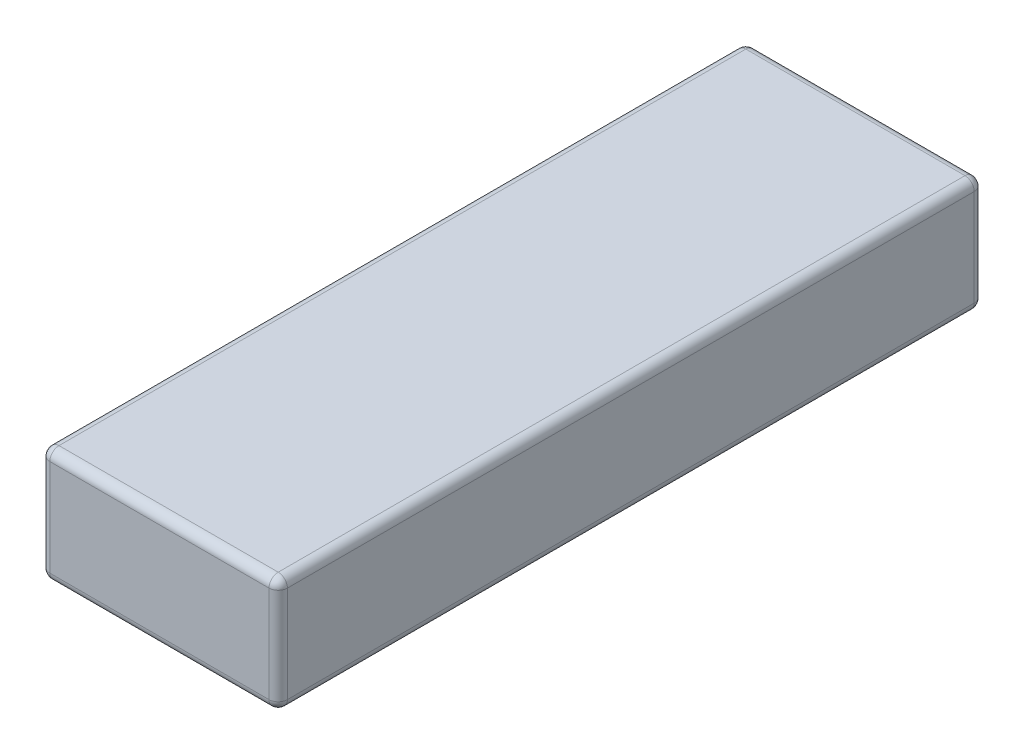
ISO-10303-21;
HEADER;
FILE_DESCRIPTION(('STEP AP214'),'2;1');
FILE_NAME('part.step','',(''),(''),'','','');
FILE_SCHEMA(('AUTOMOTIVE_DESIGN { 1 0 10303 214 1 1 1 1 }'));
ENDSEC;
DATA;
#1=APPLICATION_CONTEXT('core data for automotive mechanical design processes');
#2=APPLICATION_PROTOCOL_DEFINITION('international standard','automotive_design',2000,#1);
#3=PRODUCT_CONTEXT('',#1,'mechanical');
#4=PRODUCT('Part','Part','',(#3));
#5=PRODUCT_RELATED_PRODUCT_CATEGORY('part','',(#4));
#6=PRODUCT_DEFINITION_FORMATION('','',#4);
#7=PRODUCT_DEFINITION_CONTEXT('part definition',#1,'design');
#8=PRODUCT_DEFINITION('design','',#6,#7);
#9=PRODUCT_DEFINITION_SHAPE('','',#8);
#10=(LENGTH_UNIT() NAMED_UNIT(*) SI_UNIT(.MILLI.,.METRE.));
#11=(NAMED_UNIT(*) PLANE_ANGLE_UNIT() SI_UNIT($,.RADIAN.));
#12=(NAMED_UNIT(*) SI_UNIT($,.STERADIAN.) SOLID_ANGLE_UNIT());
#13=UNCERTAINTY_MEASURE_WITH_UNIT(LENGTH_MEASURE(1.E-05),#10,'distance_accuracy_value','');
#14=(GEOMETRIC_REPRESENTATION_CONTEXT(3) GLOBAL_UNCERTAINTY_ASSIGNED_CONTEXT((#13)) GLOBAL_UNIT_ASSIGNED_CONTEXT((#10,
#11,#12)) REPRESENTATION_CONTEXT('',''));
#15=CARTESIAN_POINT('',(0.,0.,0.));
#16=DIRECTION('',(0.,0.,1.));
#17=DIRECTION('',(1.,0.,0.));
#18=AXIS2_PLACEMENT_3D('',#15,#16,#17);
#19=CARTESIAN_POINT('',(38.75,18.75,115.));
#20=DIRECTION('',(-1.,0.,0.));
#21=DIRECTION('',(0.,0.,1.));
#22=AXIS2_PLACEMENT_3D('',#19,#20,#21);
#23=PLANE('',#22);
#24=DIRECTION('',(0.,1.,0.));
#25=VECTOR('',#24,1.);
#26=CARTESIAN_POINT('',(38.75,-18.75,112.));
#27=LINE('',#26,#25);
#28=CARTESIAN_POINT('',(38.75,15.75,112.));
#29=VERTEX_POINT('',#28);
#30=CARTESIAN_POINT('',(38.75,-15.75,112.));
#31=VERTEX_POINT('',#30);
#32=EDGE_CURVE('E221',#29,#31,#27,.F.);
#33=ORIENTED_EDGE('',*,*,#32,.T.);
#34=DIRECTION('',(0.,0.,-1.));
#35=VECTOR('',#34,1.);
#36=CARTESIAN_POINT('',(38.75,-15.75,115.));
#37=LINE('',#36,#35);
#38=CARTESIAN_POINT('',(38.75,-15.75,-112.));
#39=VERTEX_POINT('',#38);
#40=EDGE_CURVE('E224',#31,#39,#37,.T.);
#41=ORIENTED_EDGE('',*,*,#40,.T.);
#42=DIRECTION('',(0.,1.,0.));
#43=VECTOR('',#42,1.);
#44=CARTESIAN_POINT('',(38.75,18.75,-112.));
#45=LINE('',#44,#43);
#46=CARTESIAN_POINT('',(38.75,15.75,-112.));
#47=VERTEX_POINT('',#46);
#48=EDGE_CURVE('E218',#39,#47,#45,.T.);
#49=ORIENTED_EDGE('',*,*,#48,.T.);
#50=DIRECTION('',(0.,0.,-1.));
#51=VECTOR('',#50,1.);
#52=CARTESIAN_POINT('',(38.75,15.75,115.));
#53=LINE('',#52,#51);
#54=EDGE_CURVE('E215',#47,#29,#53,.F.);
#55=ORIENTED_EDGE('',*,*,#54,.T.);
#56=EDGE_LOOP('',(#33,#41,#49,#55));
#57=FACE_BOUND('',#56,.T.);
#58=ADVANCED_FACE('F39',(#57),#23,.F.);
#59=CARTESIAN_POINT('',(-38.75,18.75,115.));
#60=DIRECTION('',(0.,-1.,0.));
#61=DIRECTION('',(0.,0.,-1.));
#62=AXIS2_PLACEMENT_3D('',#59,#60,#61);
#63=PLANE('',#62);
#64=DIRECTION('',(-1.,0.,0.));
#65=VECTOR('',#64,1.);
#66=CARTESIAN_POINT('',(38.75,18.75,112.));
#67=LINE('',#66,#65);
#68=CARTESIAN_POINT('',(-35.75,18.75,112.));
#69=VERTEX_POINT('',#68);
#70=CARTESIAN_POINT('',(35.75,18.75,112.));
#71=VERTEX_POINT('',#70);
#72=EDGE_CURVE('E49',#69,#71,#67,.F.);
#73=ORIENTED_EDGE('',*,*,#72,.T.);
#74=DIRECTION('',(0.,0.,-1.));
#75=VECTOR('',#74,1.);
#76=CARTESIAN_POINT('',(35.75,18.75,115.));
#77=LINE('',#76,#75);
#78=CARTESIAN_POINT('',(35.75,18.75,-112.));
#79=VERTEX_POINT('',#78);
#80=EDGE_CURVE('E11',#71,#79,#77,.T.);
#81=ORIENTED_EDGE('',*,*,#80,.T.);
#82=DIRECTION('',(-1.,0.,0.));
#83=VECTOR('',#82,1.);
#84=CARTESIAN_POINT('',(-38.75,18.75,-112.));
#85=LINE('',#84,#83);
#86=CARTESIAN_POINT('',(-35.75,18.75,-112.));
#87=VERTEX_POINT('',#86);
#88=EDGE_CURVE('E228',#79,#87,#85,.T.);
#89=ORIENTED_EDGE('',*,*,#88,.T.);
#90=DIRECTION('',(0.,0.,-1.));
#91=VECTOR('',#90,1.);
#92=CARTESIAN_POINT('',(-35.75,18.75,115.));
#93=LINE('',#92,#91);
#94=EDGE_CURVE('E60',#87,#69,#93,.F.);
#95=ORIENTED_EDGE('',*,*,#94,.T.);
#96=EDGE_LOOP('',(#73,#81,#89,#95));
#97=FACE_BOUND('',#96,.T.);
#98=ADVANCED_FACE('F346',(#97),#63,.F.);
#99=CARTESIAN_POINT('',(-38.75,18.75,115.));
#100=DIRECTION('',(1.,0.,0.));
#101=DIRECTION('',(0.,1.,0.));
#102=AXIS2_PLACEMENT_3D('',#99,#100,#101);
#103=PLANE('',#102);
#104=DIRECTION('',(0.,0.,-1.));
#105=VECTOR('',#104,1.);
#106=CARTESIAN_POINT('',(-38.75,15.75,115.));
#107=LINE('',#106,#105);
#108=CARTESIAN_POINT('',(-38.75,15.75,112.));
#109=VERTEX_POINT('',#108);
#110=CARTESIAN_POINT('',(-38.75,15.75,-112.));
#111=VERTEX_POINT('',#110);
#112=EDGE_CURVE('E132',#109,#111,#107,.T.);
#113=ORIENTED_EDGE('',*,*,#112,.T.);
#114=DIRECTION('',(0.,-1.,0.));
#115=VECTOR('',#114,1.);
#116=CARTESIAN_POINT('',(-38.75,18.75,-112.));
#117=LINE('',#116,#115);
#118=CARTESIAN_POINT('',(-38.75,-15.75,-112.));
#119=VERTEX_POINT('',#118);
#120=EDGE_CURVE('E174',#111,#119,#117,.T.);
#121=ORIENTED_EDGE('',*,*,#120,.T.);
#122=DIRECTION('',(0.,0.,-1.));
#123=VECTOR('',#122,1.);
#124=CARTESIAN_POINT('',(-38.75,-15.75,115.));
#125=LINE('',#124,#123);
#126=CARTESIAN_POINT('',(-38.75,-15.75,112.));
#127=VERTEX_POINT('',#126);
#128=EDGE_CURVE('E135',#119,#127,#125,.F.);
#129=ORIENTED_EDGE('',*,*,#128,.T.);
#130=DIRECTION('',(0.,-1.,0.));
#131=VECTOR('',#130,1.);
#132=CARTESIAN_POINT('',(-38.75,18.75,112.));
#133=LINE('',#132,#131);
#134=EDGE_CURVE('E127',#127,#109,#133,.F.);
#135=ORIENTED_EDGE('',*,*,#134,.T.);
#136=EDGE_LOOP('',(#113,#121,#129,#135));
#137=FACE_BOUND('',#136,.T.);
#138=ADVANCED_FACE('F129',(#137),#103,.F.);
#139=CARTESIAN_POINT('',(-38.75,-18.75,115.));
#140=DIRECTION('',(0.,1.,0.));
#141=DIRECTION('',(0.,0.,1.));
#142=AXIS2_PLACEMENT_3D('',#139,#140,#141);
#143=PLANE('',#142);
#144=DIRECTION('',(1.,0.,0.));
#145=VECTOR('',#144,1.);
#146=CARTESIAN_POINT('',(-38.75,-18.75,112.));
#147=LINE('',#146,#145);
#148=CARTESIAN_POINT('',(35.75,-18.75,112.));
#149=VERTEX_POINT('',#148);
#150=CARTESIAN_POINT('',(-35.75,-18.75,112.));
#151=VERTEX_POINT('',#150);
#152=EDGE_CURVE('E193',#149,#151,#147,.F.);
#153=ORIENTED_EDGE('',*,*,#152,.T.);
#154=DIRECTION('',(0.,0.,-1.));
#155=VECTOR('',#154,1.);
#156=CARTESIAN_POINT('',(-35.75,-18.75,115.));
#157=LINE('',#156,#155);
#158=CARTESIAN_POINT('',(-35.75,-18.75,-112.));
#159=VERTEX_POINT('',#158);
#160=EDGE_CURVE('E199',#151,#159,#157,.T.);
#161=ORIENTED_EDGE('',*,*,#160,.T.);
#162=DIRECTION('',(1.,0.,0.));
#163=VECTOR('',#162,1.);
#164=CARTESIAN_POINT('',(-38.75,-18.75,-112.));
#165=LINE('',#164,#163);
#166=CARTESIAN_POINT('',(35.75,-18.75,-112.));
#167=VERTEX_POINT('',#166);
#168=EDGE_CURVE('E196',#159,#167,#165,.T.);
#169=ORIENTED_EDGE('',*,*,#168,.T.);
#170=DIRECTION('',(0.,0.,-1.));
#171=VECTOR('',#170,1.);
#172=CARTESIAN_POINT('',(35.75,-18.75,115.));
#173=LINE('',#172,#171);
#174=EDGE_CURVE('E190',#167,#149,#173,.F.);
#175=ORIENTED_EDGE('',*,*,#174,.T.);
#176=EDGE_LOOP('',(#153,#161,#169,#175));
#177=FACE_BOUND('',#176,.T.);
#178=ADVANCED_FACE('F329',(#177),#143,.F.);
#179=CARTESIAN_POINT('',(0.,0.,115.));
#180=DIRECTION('',(0.,0.,1.));
#181=DIRECTION('',(1.,0.,0.));
#182=AXIS2_PLACEMENT_3D('',#179,#180,#181);
#183=PLANE('',#182);
#184=DIRECTION('',(0.,-1.,0.));
#185=VECTOR('',#184,1.);
#186=CARTESIAN_POINT('',(-35.75,-18.75,115.));
#187=LINE('',#186,#185);
#188=CARTESIAN_POINT('',(-35.75,15.75,115.));
#189=VERTEX_POINT('',#188);
#190=CARTESIAN_POINT('',(-35.75,-15.75,115.));
#191=VERTEX_POINT('',#190);
#192=EDGE_CURVE('E146',#189,#191,#187,.T.);
#193=ORIENTED_EDGE('',*,*,#192,.T.);
#194=DIRECTION('',(1.,0.,0.));
#195=VECTOR('',#194,1.);
#196=CARTESIAN_POINT('',(38.75,-15.75,115.));
#197=LINE('',#196,#195);
#198=CARTESIAN_POINT('',(35.75,-15.75,115.));
#199=VERTEX_POINT('',#198);
#200=EDGE_CURVE('E211',#191,#199,#197,.T.);
#201=ORIENTED_EDGE('',*,*,#200,.T.);
#202=DIRECTION('',(0.,1.,0.));
#203=VECTOR('',#202,1.);
#204=CARTESIAN_POINT('',(35.75,18.75,115.));
#205=LINE('',#204,#203);
#206=CARTESIAN_POINT('',(35.75,15.75,115.));
#207=VERTEX_POINT('',#206);
#208=EDGE_CURVE('E206',#199,#207,#205,.T.);
#209=ORIENTED_EDGE('',*,*,#208,.T.);
#210=DIRECTION('',(-1.,0.,0.));
#211=VECTOR('',#210,1.);
#212=CARTESIAN_POINT('',(-38.75,15.75,115.));
#213=LINE('',#212,#211);
#214=EDGE_CURVE('E203',#207,#189,#213,.T.);
#215=ORIENTED_EDGE('',*,*,#214,.T.);
#216=EDGE_LOOP('',(#193,#201,#209,#215));
#217=FACE_BOUND('',#216,.T.);
#218=ADVANCED_FACE('F316',(#217),#183,.T.);
#219=CARTESIAN_POINT('',(0.,0.,-115.));
#220=DIRECTION('',(0.,0.,1.));
#221=DIRECTION('',(1.,0.,0.));
#222=AXIS2_PLACEMENT_3D('',#219,#220,#221);
#223=PLANE('',#222);
#224=DIRECTION('',(1.,0.,0.));
#225=VECTOR('',#224,1.);
#226=CARTESIAN_POINT('',(0.,-15.75,-115.));
#227=LINE('',#226,#225);
#228=CARTESIAN_POINT('',(35.75,-15.75,-115.));
#229=VERTEX_POINT('',#228);
#230=CARTESIAN_POINT('',(-35.75,-15.75,-115.));
#231=VERTEX_POINT('',#230);
#232=EDGE_CURVE('E183',#229,#231,#227,.F.);
#233=ORIENTED_EDGE('',*,*,#232,.T.);
#234=DIRECTION('',(0.,-1.,0.));
#235=VECTOR('',#234,1.);
#236=CARTESIAN_POINT('',(-35.75,0.,-115.));
#237=LINE('',#236,#235);
#238=CARTESIAN_POINT('',(-35.75,15.75,-115.));
#239=VERTEX_POINT('',#238);
#240=EDGE_CURVE('E186',#231,#239,#237,.F.);
#241=ORIENTED_EDGE('',*,*,#240,.T.);
#242=DIRECTION('',(-1.,0.,0.));
#243=VECTOR('',#242,1.);
#244=CARTESIAN_POINT('',(0.,15.75,-115.));
#245=LINE('',#244,#243);
#246=CARTESIAN_POINT('',(35.75,15.75,-115.));
#247=VERTEX_POINT('',#246);
#248=EDGE_CURVE('E177',#239,#247,#245,.F.);
#249=ORIENTED_EDGE('',*,*,#248,.T.);
#250=DIRECTION('',(0.,1.,0.));
#251=VECTOR('',#250,1.);
#252=CARTESIAN_POINT('',(35.75,0.,-115.));
#253=LINE('',#252,#251);
#254=EDGE_CURVE('E180',#247,#229,#253,.F.);
#255=ORIENTED_EDGE('',*,*,#254,.T.);
#256=EDGE_LOOP('',(#233,#241,#249,#255));
#257=FACE_BOUND('',#256,.T.);
#258=ADVANCED_FACE('F532',(#257),#223,.F.);
#259=CARTESIAN_POINT('',(35.75,0.,112.));
#260=DIRECTION('',(0.,-1.,0.));
#261=DIRECTION('',(0.,0.,-1.));
#262=AXIS2_PLACEMENT_3D('',#259,#260,#261);
#263=CYLINDRICAL_SURFACE('',#262,3.);
#264=CARTESIAN_POINT('',(35.75,15.75,112.));
#265=DIRECTION('',(0.,1.,0.));
#266=DIRECTION('',(0.,0.,1.));
#267=AXIS2_PLACEMENT_3D('',#264,#265,#266);
#268=CIRCLE('',#267,3.);
#269=EDGE_CURVE('E43',#207,#29,#268,.T.);
#270=ORIENTED_EDGE('',*,*,#269,.F.);
#271=ORIENTED_EDGE('',*,*,#208,.F.);
#272=CARTESIAN_POINT('',(35.75,-15.75,112.));
#273=DIRECTION('',(0.,-1.,0.));
#274=DIRECTION('',(0.,0.,-1.));
#275=AXIS2_PLACEMENT_3D('',#272,#273,#274);
#276=CIRCLE('',#275,3.);
#277=EDGE_CURVE('E170',#31,#199,#276,.T.);
#278=ORIENTED_EDGE('',*,*,#277,.F.);
#279=ORIENTED_EDGE('',*,*,#32,.F.);
#280=EDGE_LOOP('',(#270,#271,#278,#279));
#281=FACE_BOUND('',#280,.T.);
#282=ADVANCED_FACE('F41',(#281),#263,.T.);
#283=CARTESIAN_POINT('',(35.75,15.75,112.));
#284=DIRECTION('',(0.,0.,1.));
#285=DIRECTION('',(1.,0.,0.));
#286=AXIS2_PLACEMENT_3D('',#283,#284,#285);
#287=SPHERICAL_SURFACE('',#286,3.);
#288=CARTESIAN_POINT('',(35.75,15.75,112.));
#289=DIRECTION('',(1.,0.,0.));
#290=DIRECTION('',(0.,0.,-1.));
#291=AXIS2_PLACEMENT_3D('',#288,#289,#290);
#292=CIRCLE('',#291,3.);
#293=EDGE_CURVE('E294',#207,#71,#292,.F.);
#294=ORIENTED_EDGE('',*,*,#293,.F.);
#295=ORIENTED_EDGE('',*,*,#269,.T.);
#296=CARTESIAN_POINT('',(35.75,15.75,112.));
#297=DIRECTION('',(0.,0.,1.));
#298=DIRECTION('',(1.,0.,0.));
#299=AXIS2_PLACEMENT_3D('',#296,#297,#298);
#300=CIRCLE('',#299,3.);
#301=EDGE_CURVE('E297',#71,#29,#300,.F.);
#302=ORIENTED_EDGE('',*,*,#301,.F.);
#303=EDGE_LOOP('',(#294,#295,#302));
#304=FACE_BOUND('',#303,.T.);
#305=ADVANCED_FACE('F339',(#304),#287,.T.);
#306=CARTESIAN_POINT('',(35.75,-15.75,112.));
#307=DIRECTION('',(0.,0.,1.));
#308=DIRECTION('',(1.,0.,0.));
#309=AXIS2_PLACEMENT_3D('',#306,#307,#308);
#310=SPHERICAL_SURFACE('',#309,3.);
#311=CARTESIAN_POINT('',(35.75,-15.75,112.));
#312=DIRECTION('',(0.,0.,1.));
#313=DIRECTION('',(1.,0.,0.));
#314=AXIS2_PLACEMENT_3D('',#311,#312,#313);
#315=CIRCLE('',#314,3.);
#316=EDGE_CURVE('E287',#31,#149,#315,.F.);
#317=ORIENTED_EDGE('',*,*,#316,.F.);
#318=ORIENTED_EDGE('',*,*,#277,.T.);
#319=CARTESIAN_POINT('',(35.75,-15.75,112.));
#320=DIRECTION('',(1.,0.,0.));
#321=DIRECTION('',(0.,0.,-1.));
#322=AXIS2_PLACEMENT_3D('',#319,#320,#321);
#323=CIRCLE('',#322,3.);
#324=EDGE_CURVE('E291',#149,#199,#323,.F.);
#325=ORIENTED_EDGE('',*,*,#324,.F.);
#326=EDGE_LOOP('',(#317,#318,#325));
#327=FACE_BOUND('',#326,.T.);
#328=ADVANCED_FACE('F307',(#327),#310,.T.);
#329=CARTESIAN_POINT('',(35.75,15.75,115.));
#330=DIRECTION('',(0.,0.,-1.));
#331=DIRECTION('',(-1.,0.,0.));
#332=AXIS2_PLACEMENT_3D('',#329,#330,#331);
#333=CYLINDRICAL_SURFACE('',#332,3.);
#334=ORIENTED_EDGE('',*,*,#301,.T.);
#335=ORIENTED_EDGE('',*,*,#54,.F.);
#336=CARTESIAN_POINT('',(35.75,15.75,-112.));
#337=DIRECTION('',(0.,0.,-1.));
#338=DIRECTION('',(-1.,0.,0.));
#339=AXIS2_PLACEMENT_3D('',#336,#337,#338);
#340=CIRCLE('',#339,3.);
#341=EDGE_CURVE('E279',#79,#47,#340,.T.);
#342=ORIENTED_EDGE('',*,*,#341,.F.);
#343=ORIENTED_EDGE('',*,*,#80,.F.);
#344=EDGE_LOOP('',(#334,#335,#342,#343));
#345=FACE_BOUND('',#344,.T.);
#346=ADVANCED_FACE('F343',(#345),#333,.T.);
#347=CARTESIAN_POINT('',(0.,15.75,112.));
#348=DIRECTION('',(1.,0.,0.));
#349=DIRECTION('',(0.,0.,-1.));
#350=AXIS2_PLACEMENT_3D('',#347,#348,#349);
#351=CYLINDRICAL_SURFACE('',#350,3.);
#352=ORIENTED_EDGE('',*,*,#293,.T.);
#353=ORIENTED_EDGE('',*,*,#72,.F.);
#354=CARTESIAN_POINT('',(-35.75,15.75,112.));
#355=DIRECTION('',(-1.,0.,0.));
#356=DIRECTION('',(0.,0.,1.));
#357=AXIS2_PLACEMENT_3D('',#354,#355,#356);
#358=CIRCLE('',#357,3.);
#359=EDGE_CURVE('E151',#189,#69,#358,.T.);
#360=ORIENTED_EDGE('',*,*,#359,.F.);
#361=ORIENTED_EDGE('',*,*,#214,.F.);
#362=EDGE_LOOP('',(#352,#353,#360,#361));
#363=FACE_BOUND('',#362,.T.);
#364=ADVANCED_FACE('F496',(#363),#351,.T.);
#365=CARTESIAN_POINT('',(-35.75,0.,112.));
#366=DIRECTION('',(0.,1.,0.));
#367=DIRECTION('',(-1.,0.,0.));
#368=AXIS2_PLACEMENT_3D('',#365,#366,#367);
#369=CYLINDRICAL_SURFACE('',#368,3.);
#370=CARTESIAN_POINT('',(-35.75,-15.75,112.));
#371=DIRECTION('',(0.,-1.,0.));
#372=DIRECTION('',(0.,0.,-1.));
#373=AXIS2_PLACEMENT_3D('',#370,#371,#372);
#374=CIRCLE('',#373,3.);
#375=EDGE_CURVE('E152',#191,#127,#374,.T.);
#376=ORIENTED_EDGE('',*,*,#375,.F.);
#377=ORIENTED_EDGE('',*,*,#192,.F.);
#378=CARTESIAN_POINT('',(-35.75,15.75,112.));
#379=DIRECTION('',(0.,1.,0.));
#380=DIRECTION('',(0.,0.,1.));
#381=AXIS2_PLACEMENT_3D('',#378,#379,#380);
#382=CIRCLE('',#381,3.);
#383=EDGE_CURVE('E143',#109,#189,#382,.T.);
#384=ORIENTED_EDGE('',*,*,#383,.F.);
#385=ORIENTED_EDGE('',*,*,#134,.F.);
#386=EDGE_LOOP('',(#376,#377,#384,#385));
#387=FACE_BOUND('',#386,.T.);
#388=ADVANCED_FACE('F145',(#387),#369,.T.);
#389=CARTESIAN_POINT('',(0.,-15.75,112.));
#390=DIRECTION('',(-1.,0.,0.));
#391=DIRECTION('',(0.,0.,1.));
#392=AXIS2_PLACEMENT_3D('',#389,#390,#391);
#393=CYLINDRICAL_SURFACE('',#392,3.);
#394=ORIENTED_EDGE('',*,*,#324,.T.);
#395=ORIENTED_EDGE('',*,*,#200,.F.);
#396=CARTESIAN_POINT('',(-35.75,-15.75,112.));
#397=DIRECTION('',(-1.,0.,0.));
#398=DIRECTION('',(0.,0.,1.));
#399=AXIS2_PLACEMENT_3D('',#396,#397,#398);
#400=CIRCLE('',#399,3.);
#401=EDGE_CURVE('E271',#151,#191,#400,.T.);
#402=ORIENTED_EDGE('',*,*,#401,.F.);
#403=ORIENTED_EDGE('',*,*,#152,.F.);
#404=EDGE_LOOP('',(#394,#395,#402,#403));
#405=FACE_BOUND('',#404,.T.);
#406=ADVANCED_FACE('F319',(#405),#393,.T.);
#407=CARTESIAN_POINT('',(35.75,-15.75,115.));
#408=DIRECTION('',(0.,0.,-1.));
#409=DIRECTION('',(-1.,0.,0.));
#410=AXIS2_PLACEMENT_3D('',#407,#408,#409);
#411=CYLINDRICAL_SURFACE('',#410,3.);
#412=ORIENTED_EDGE('',*,*,#316,.T.);
#413=ORIENTED_EDGE('',*,*,#174,.F.);
#414=CARTESIAN_POINT('',(35.75,-15.75,-112.));
#415=DIRECTION('',(0.,0.,-1.));
#416=DIRECTION('',(-1.,0.,0.));
#417=AXIS2_PLACEMENT_3D('',#414,#415,#416);
#418=CIRCLE('',#417,3.);
#419=EDGE_CURVE('E267',#39,#167,#418,.T.);
#420=ORIENTED_EDGE('',*,*,#419,.F.);
#421=ORIENTED_EDGE('',*,*,#40,.F.);
#422=EDGE_LOOP('',(#412,#413,#420,#421));
#423=FACE_BOUND('',#422,.T.);
#424=ADVANCED_FACE('F333',(#423),#411,.T.);
#425=CARTESIAN_POINT('',(35.75,18.75,-112.));
#426=DIRECTION('',(0.,1.,0.));
#427=DIRECTION('',(0.,0.,1.));
#428=AXIS2_PLACEMENT_3D('',#425,#426,#427);
#429=CYLINDRICAL_SURFACE('',#428,3.);
#430=CARTESIAN_POINT('',(35.75,15.75,-112.));
#431=DIRECTION('',(0.,1.,0.));
#432=DIRECTION('',(0.,0.,1.));
#433=AXIS2_PLACEMENT_3D('',#430,#431,#432);
#434=CIRCLE('',#433,3.);
#435=EDGE_CURVE('E283',#47,#247,#434,.T.);
#436=ORIENTED_EDGE('',*,*,#435,.F.);
#437=ORIENTED_EDGE('',*,*,#48,.F.);
#438=CARTESIAN_POINT('',(35.75,-15.75,-112.));
#439=DIRECTION('',(0.,-1.,0.));
#440=DIRECTION('',(1.,0.,0.));
#441=AXIS2_PLACEMENT_3D('',#438,#439,#440);
#442=CIRCLE('',#441,3.);
#443=EDGE_CURVE('E264',#229,#39,#442,.T.);
#444=ORIENTED_EDGE('',*,*,#443,.F.);
#445=ORIENTED_EDGE('',*,*,#254,.F.);
#446=EDGE_LOOP('',(#436,#437,#444,#445));
#447=FACE_BOUND('',#446,.T.);
#448=ADVANCED_FACE('F371',(#447),#429,.T.);
#449=CARTESIAN_POINT('',(35.75,15.75,-112.));
#450=DIRECTION('',(0.,0.,1.));
#451=DIRECTION('',(1.,0.,0.));
#452=AXIS2_PLACEMENT_3D('',#449,#450,#451);
#453=SPHERICAL_SURFACE('',#452,3.);
#454=ORIENTED_EDGE('',*,*,#341,.T.);
#455=ORIENTED_EDGE('',*,*,#435,.T.);
#456=CARTESIAN_POINT('',(35.75,15.75,-112.));
#457=DIRECTION('',(1.,0.,0.));
#458=DIRECTION('',(0.,0.,-1.));
#459=AXIS2_PLACEMENT_3D('',#456,#457,#458);
#460=CIRCLE('',#459,3.);
#461=EDGE_CURVE('E159',#79,#247,#460,.F.);
#462=ORIENTED_EDGE('',*,*,#461,.F.);
#463=EDGE_LOOP('',(#454,#455,#462));
#464=FACE_BOUND('',#463,.T.);
#465=ADVANCED_FACE('F373',(#464),#453,.T.);
#466=CARTESIAN_POINT('',(-35.75,15.75,112.));
#467=DIRECTION('',(0.,0.,1.));
#468=DIRECTION('',(1.,0.,0.));
#469=AXIS2_PLACEMENT_3D('',#466,#467,#468);
#470=SPHERICAL_SURFACE('',#469,3.);
#471=ORIENTED_EDGE('',*,*,#383,.T.);
#472=ORIENTED_EDGE('',*,*,#359,.T.);
#473=CARTESIAN_POINT('',(-35.75,15.75,112.));
#474=DIRECTION('',(0.,0.,1.));
#475=DIRECTION('',(1.,0.,0.));
#476=AXIS2_PLACEMENT_3D('',#473,#474,#475);
#477=CIRCLE('',#476,3.);
#478=EDGE_CURVE('E155',#109,#69,#477,.F.);
#479=ORIENTED_EDGE('',*,*,#478,.F.);
#480=EDGE_LOOP('',(#471,#472,#479));
#481=FACE_BOUND('',#480,.T.);
#482=ADVANCED_FACE('F156',(#481),#470,.T.);
#483=CARTESIAN_POINT('',(-35.75,-15.75,112.));
#484=DIRECTION('',(0.,0.,1.));
#485=DIRECTION('',(1.,0.,0.));
#486=AXIS2_PLACEMENT_3D('',#483,#484,#485);
#487=SPHERICAL_SURFACE('',#486,3.);
#488=ORIENTED_EDGE('',*,*,#401,.T.);
#489=ORIENTED_EDGE('',*,*,#375,.T.);
#490=CARTESIAN_POINT('',(-35.75,-15.75,112.));
#491=DIRECTION('',(0.,0.,1.));
#492=DIRECTION('',(1.,0.,0.));
#493=AXIS2_PLACEMENT_3D('',#490,#491,#492);
#494=CIRCLE('',#493,3.);
#495=EDGE_CURVE('E160',#151,#127,#494,.F.);
#496=ORIENTED_EDGE('',*,*,#495,.F.);
#497=EDGE_LOOP('',(#488,#489,#496));
#498=FACE_BOUND('',#497,.T.);
#499=ADVANCED_FACE('F322',(#498),#487,.T.);
#500=CARTESIAN_POINT('',(35.75,-15.75,-112.));
#501=DIRECTION('',(0.,0.,1.));
#502=DIRECTION('',(1.,0.,0.));
#503=AXIS2_PLACEMENT_3D('',#500,#501,#502);
#504=SPHERICAL_SURFACE('',#503,3.);
#505=ORIENTED_EDGE('',*,*,#443,.T.);
#506=ORIENTED_EDGE('',*,*,#419,.T.);
#507=CARTESIAN_POINT('',(35.75,-15.75,-112.));
#508=DIRECTION('',(1.,0.,0.));
#509=DIRECTION('',(0.,0.,-1.));
#510=AXIS2_PLACEMENT_3D('',#507,#508,#509);
#511=CIRCLE('',#510,3.);
#512=EDGE_CURVE('E254',#229,#167,#511,.F.);
#513=ORIENTED_EDGE('',*,*,#512,.F.);
#514=EDGE_LOOP('',(#505,#506,#513));
#515=FACE_BOUND('',#514,.T.);
#516=ADVANCED_FACE('F367',(#515),#504,.T.);
#517=CARTESIAN_POINT('',(-38.75,15.75,-112.));
#518=DIRECTION('',(-1.,0.,0.));
#519=DIRECTION('',(0.,0.,1.));
#520=AXIS2_PLACEMENT_3D('',#517,#518,#519);
#521=CYLINDRICAL_SURFACE('',#520,3.);
#522=ORIENTED_EDGE('',*,*,#461,.T.);
#523=ORIENTED_EDGE('',*,*,#248,.F.);
#524=CARTESIAN_POINT('',(-35.75,15.75,-112.));
#525=DIRECTION('',(-1.,0.,0.));
#526=DIRECTION('',(0.,0.,1.));
#527=AXIS2_PLACEMENT_3D('',#524,#525,#526);
#528=CIRCLE('',#527,3.);
#529=EDGE_CURVE('E250',#87,#239,#528,.T.);
#530=ORIENTED_EDGE('',*,*,#529,.F.);
#531=ORIENTED_EDGE('',*,*,#88,.F.);
#532=EDGE_LOOP('',(#522,#523,#530,#531));
#533=FACE_BOUND('',#532,.T.);
#534=ADVANCED_FACE('F351',(#533),#521,.T.);
#535=CARTESIAN_POINT('',(-35.75,15.75,115.));
#536=DIRECTION('',(0.,0.,-1.));
#537=DIRECTION('',(-1.,0.,0.));
#538=AXIS2_PLACEMENT_3D('',#535,#536,#537);
#539=CYLINDRICAL_SURFACE('',#538,3.);
#540=ORIENTED_EDGE('',*,*,#478,.T.);
#541=ORIENTED_EDGE('',*,*,#94,.F.);
#542=CARTESIAN_POINT('',(-35.75,15.75,-112.));
#543=DIRECTION('',(0.,0.,-1.));
#544=DIRECTION('',(-1.,0.,0.));
#545=AXIS2_PLACEMENT_3D('',#542,#543,#544);
#546=CIRCLE('',#545,3.);
#547=EDGE_CURVE('E164',#111,#87,#546,.T.);
#548=ORIENTED_EDGE('',*,*,#547,.F.);
#549=ORIENTED_EDGE('',*,*,#112,.F.);
#550=EDGE_LOOP('',(#540,#541,#548,#549));
#551=FACE_BOUND('',#550,.T.);
#552=ADVANCED_FACE('F162',(#551),#539,.T.);
#553=CARTESIAN_POINT('',(-35.75,-15.75,115.));
#554=DIRECTION('',(0.,0.,-1.));
#555=DIRECTION('',(-1.,0.,0.));
#556=AXIS2_PLACEMENT_3D('',#553,#554,#555);
#557=CYLINDRICAL_SURFACE('',#556,3.);
#558=ORIENTED_EDGE('',*,*,#495,.T.);
#559=ORIENTED_EDGE('',*,*,#128,.F.);
#560=CARTESIAN_POINT('',(-35.75,-15.75,-112.));
#561=DIRECTION('',(0.,0.,-1.));
#562=DIRECTION('',(-1.,0.,0.));
#563=AXIS2_PLACEMENT_3D('',#560,#561,#562);
#564=CIRCLE('',#563,3.);
#565=EDGE_CURVE('E244',#159,#119,#564,.T.);
#566=ORIENTED_EDGE('',*,*,#565,.F.);
#567=ORIENTED_EDGE('',*,*,#160,.F.);
#568=EDGE_LOOP('',(#558,#559,#566,#567));
#569=FACE_BOUND('',#568,.T.);
#570=ADVANCED_FACE('F326',(#569),#557,.T.);
#571=CARTESIAN_POINT('',(-38.75,-15.75,-112.));
#572=DIRECTION('',(1.,0.,0.));
#573=DIRECTION('',(0.,0.,-1.));
#574=AXIS2_PLACEMENT_3D('',#571,#572,#573);
#575=CYLINDRICAL_SURFACE('',#574,3.);
#576=ORIENTED_EDGE('',*,*,#512,.T.);
#577=ORIENTED_EDGE('',*,*,#168,.F.);
#578=CARTESIAN_POINT('',(-35.75,-15.75,-112.));
#579=DIRECTION('',(-1.,0.,0.));
#580=DIRECTION('',(0.,0.,1.));
#581=AXIS2_PLACEMENT_3D('',#578,#579,#580);
#582=CIRCLE('',#581,3.);
#583=EDGE_CURVE('E241',#231,#159,#582,.T.);
#584=ORIENTED_EDGE('',*,*,#583,.F.);
#585=ORIENTED_EDGE('',*,*,#232,.F.);
#586=EDGE_LOOP('',(#576,#577,#584,#585));
#587=FACE_BOUND('',#586,.T.);
#588=ADVANCED_FACE('F364',(#587),#575,.T.);
#589=CARTESIAN_POINT('',(-35.75,15.75,-112.));
#590=DIRECTION('',(0.,0.,1.));
#591=DIRECTION('',(1.,0.,0.));
#592=AXIS2_PLACEMENT_3D('',#589,#590,#591);
#593=SPHERICAL_SURFACE('',#592,3.);
#594=ORIENTED_EDGE('',*,*,#547,.T.);
#595=ORIENTED_EDGE('',*,*,#529,.T.);
#596=CARTESIAN_POINT('',(-35.75,15.75,-112.));
#597=DIRECTION('',(0.,1.,0.));
#598=DIRECTION('',(0.,0.,1.));
#599=AXIS2_PLACEMENT_3D('',#596,#597,#598);
#600=CIRCLE('',#599,3.);
#601=EDGE_CURVE('E238',#111,#239,#600,.F.);
#602=ORIENTED_EDGE('',*,*,#601,.F.);
#603=EDGE_LOOP('',(#594,#595,#602));
#604=FACE_BOUND('',#603,.T.);
#605=ADVANCED_FACE('F353',(#604),#593,.T.);
#606=CARTESIAN_POINT('',(-35.75,-15.75,-112.));
#607=DIRECTION('',(0.,0.,1.));
#608=DIRECTION('',(1.,0.,0.));
#609=AXIS2_PLACEMENT_3D('',#606,#607,#608);
#610=SPHERICAL_SURFACE('',#609,3.);
#611=ORIENTED_EDGE('',*,*,#583,.T.);
#612=ORIENTED_EDGE('',*,*,#565,.T.);
#613=CARTESIAN_POINT('',(-35.75,-15.75,-112.));
#614=DIRECTION('',(0.,-1.,0.));
#615=DIRECTION('',(0.,0.,-1.));
#616=AXIS2_PLACEMENT_3D('',#613,#614,#615);
#617=CIRCLE('',#616,3.);
#618=EDGE_CURVE('E235',#231,#119,#617,.F.);
#619=ORIENTED_EDGE('',*,*,#618,.F.);
#620=EDGE_LOOP('',(#611,#612,#619));
#621=FACE_BOUND('',#620,.T.);
#622=ADVANCED_FACE('F360',(#621),#610,.T.);
#623=CARTESIAN_POINT('',(-35.75,18.75,-112.));
#624=DIRECTION('',(0.,-1.,0.));
#625=DIRECTION('',(1.,0.,0.));
#626=AXIS2_PLACEMENT_3D('',#623,#624,#625);
#627=CYLINDRICAL_SURFACE('',#626,3.);
#628=ORIENTED_EDGE('',*,*,#601,.T.);
#629=ORIENTED_EDGE('',*,*,#240,.F.);
#630=ORIENTED_EDGE('',*,*,#618,.T.);
#631=ORIENTED_EDGE('',*,*,#120,.F.);
#632=EDGE_LOOP('',(#628,#629,#630,#631));
#633=FACE_BOUND('',#632,.T.);
#634=ADVANCED_FACE('F357',(#633),#627,.T.);
#635=CLOSED_SHELL('',(#58,#98,#138,#178,#218,#258,#282,#305,#328,#346,#364,#388,#406,#424,#448,
#465,#482,#499,#516,#534,#552,#570,#588,#605,#622,#634));
#636=MANIFOLD_SOLID_BREP('B2',#635);
#637=ADVANCED_BREP_SHAPE_REPRESENTATION('',(#18,#636),#14);
#638=SHAPE_DEFINITION_REPRESENTATION(#9,#637);
ENDSEC;
END-ISO-10303-21;
